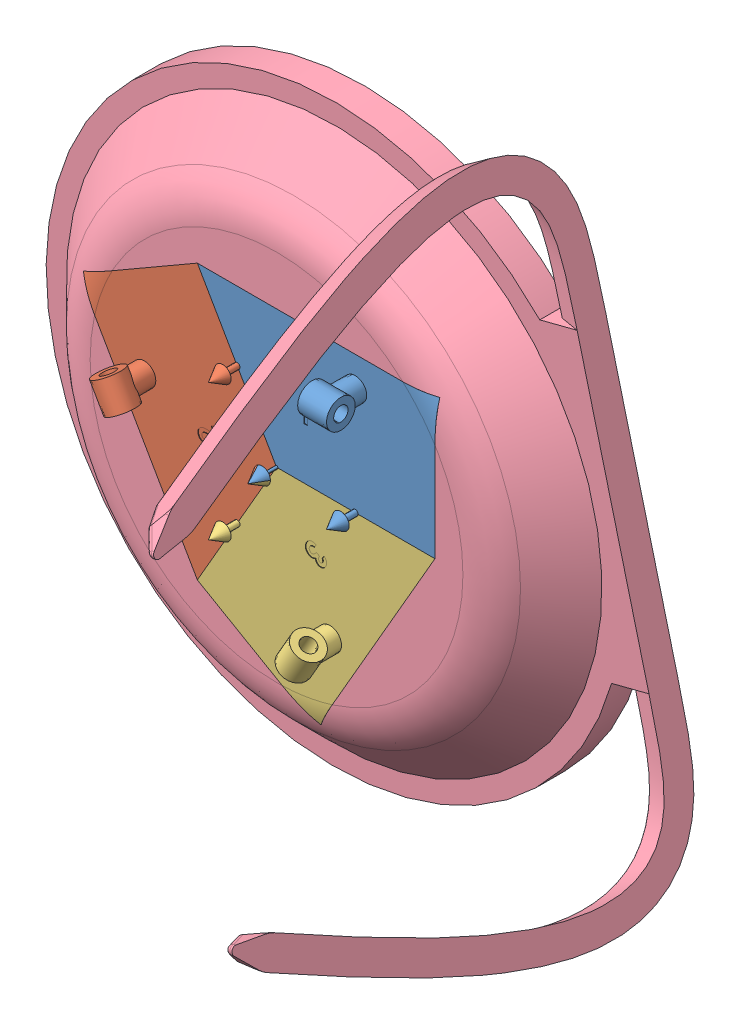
SolidWorks assembly BATI.SLDASM, configuration Défaut (file format 6000). Lengths in mm.
Overall size (309.03 310.52 159.51).
4 component instances, 4 part files, 9 mates.
Components (placement in the parent):
- BATI-1: BATI.SLDPRT [Défaut] at (-25.8654 -22.0674 0) size (82.5 50.52 25)
- BATI2-1: BATI2.SLDPRT [Défaut] at (-25.8654 -22.0674 0) x (-0.5 0.866025 0) z (0 0 1) size (82.5 50.52 25)
- BATI3-1: BATI3.SLDPRT [Défaut] at (-25.8654 -22.0674 0) x (-0.5 -0.866025 0) z (0 0 1) size (82.5 50.52 25)
- PIED-1: PIED.SLDPRT [Défaut] at (-25.8654 -22.0674 10) x (-0.5 0.866025 0) z (0 0 1) size (228.81 224.73 159.51)
Mates (geometry in assembly coordinates):
- Coïncidente1: coincident aligned: plane of BATI-1 through (29.1346 -22.0674 10) normal (0 0 1); plane of BATI2-1 through (-53.3654 25.564 10) normal (0 0 1)
- Coïncidente2: coincident aligned: plane of BATI2-1 through (-53.3654 25.564 10) normal (0 0 1); plane of BATI3-1 through (-53.3654 -69.6988 10) normal (0 0 1)
- Coïncidente5: coincident anti-aligned: plane of BATI-1 through (-53.3654 25.564 10) normal (-0.866025 -0.5 0); plane of BATI2-1 through (-25.8654 -22.0674 10) normal (0.866025 0.5 0)
- Coïncidente6: coincident aligned: line of BATI-1 through (-25.8654 -22.0674 20) axis (0 0 -1); line of BATI2-1 through (-25.8654 -22.0674 20) axis (0 0 -1)
- Coïncidente8: coincident anti-aligned: plane of BATI2-1 through (-53.3654 -69.6988 10) normal (0.866025 -0.5 0); plane of BATI3-1 through (-25.8654 -22.0674 10) normal (-0.866025 0.5 0)
- Coïncidente9: coincident anti-aligned: plane of BATI-1 through (-25.8654 -22.0674 10) normal (0 -1 0); plane of BATI3-1 through (29.1346 -22.0674 10) normal (0 1 0)
- Coïncidente13: coincident anti-aligned: plane of BATI2-1 through (-53.3654 -69.6988 10) normal (-0.866025 -0.5 0); plane of PIED-1 through (-94.6154 1.7483 0) normal (0.866025 0.5 0)
- Coïncidente14: coincident anti-aligned: plane of BATI3-1 through (29.1346 -22.0674 10) normal (0.866025 -0.5 0); plane of PIED-1 through (-12.1154 -93.5145 0) normal (-0.866025 0.5 0)
- Coïncidente17: coincident aligned: plane of BATI2-1 through (-53.3654 25.564 10) normal (0 0 1); plane of PIED-1 through (-25.8654 -22.0674 10) normal (0 0 1)
